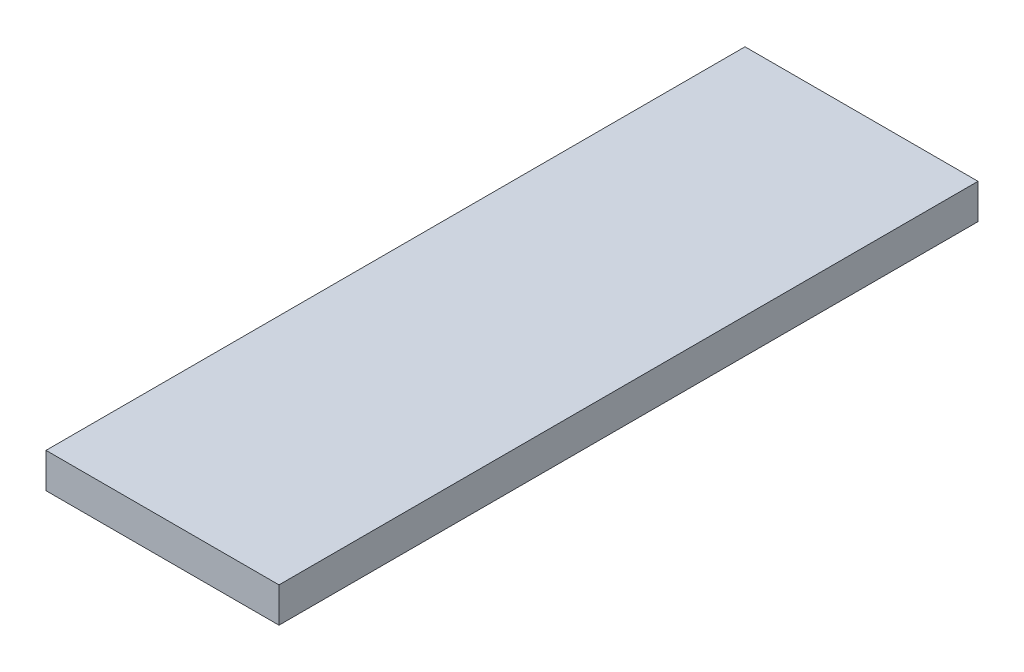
from build123d import *

# Parameters (mm, degrees)
SKETCH1_W           = 40
SKETCH1_H           = 120
BOSS_EXTRUDE1_DEPTH = 6


with BuildPart() as part:
    # Sketch1 → Boss-Extrude1 (new body)
    with BuildSketch(Plane(origin=(0, 0, 0), x_dir=(1, 0, 0), z_dir=(0, 1, 0))):
        with Locations((20, 60)):
            Rectangle(SKETCH1_W, SKETCH1_H)
    extrude(amount=BOSS_EXTRUDE1_DEPTH)


solid = part.part
